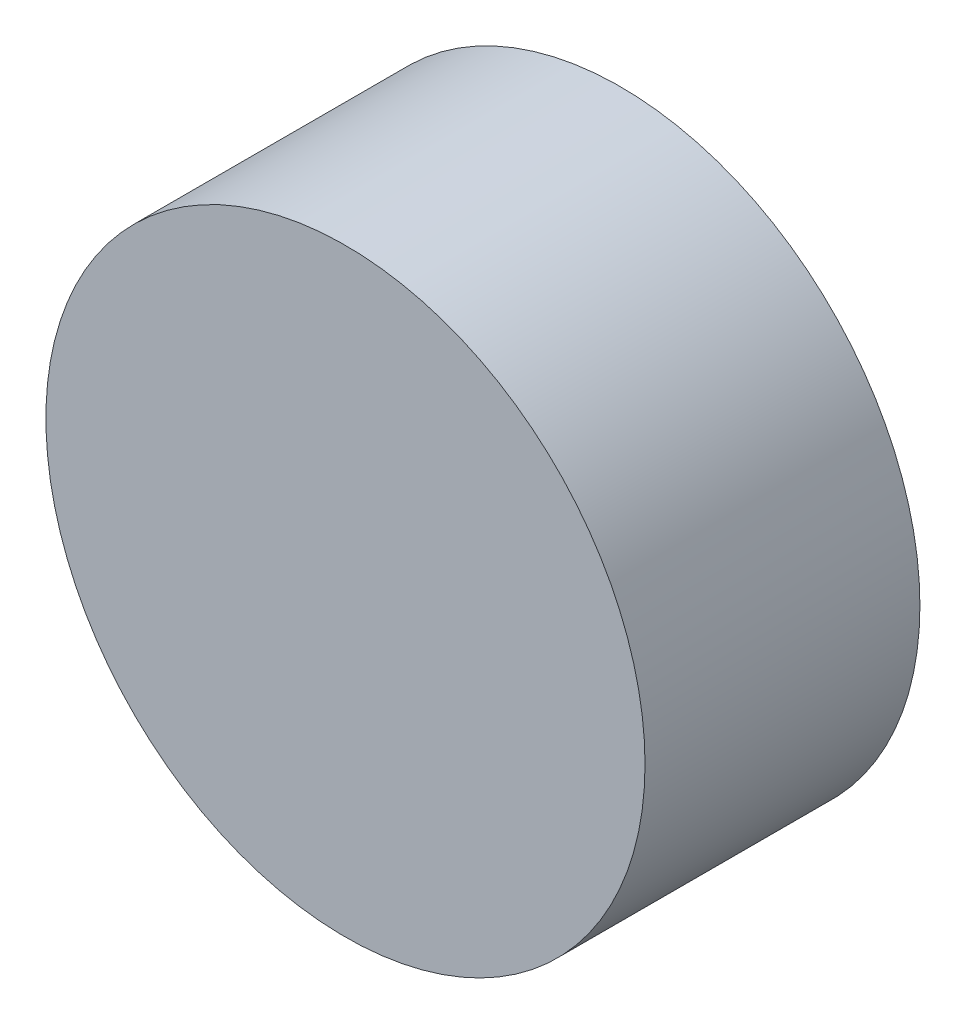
ISO-10303-21;
HEADER;
FILE_DESCRIPTION(('STEP AP214'),'2;1');
FILE_NAME('part.step','',(''),(''),'','','');
FILE_SCHEMA(('AUTOMOTIVE_DESIGN { 1 0 10303 214 1 1 1 1 }'));
ENDSEC;
DATA;
#1=APPLICATION_CONTEXT('core data for automotive mechanical design processes');
#2=APPLICATION_PROTOCOL_DEFINITION('international standard','automotive_design',2000,#1);
#3=PRODUCT_CONTEXT('',#1,'mechanical');
#4=PRODUCT('Part','Part','',(#3));
#5=PRODUCT_RELATED_PRODUCT_CATEGORY('part','',(#4));
#6=PRODUCT_DEFINITION_FORMATION('','',#4);
#7=PRODUCT_DEFINITION_CONTEXT('part definition',#1,'design');
#8=PRODUCT_DEFINITION('design','',#6,#7);
#9=PRODUCT_DEFINITION_SHAPE('','',#8);
#10=(LENGTH_UNIT() NAMED_UNIT(*) SI_UNIT(.MILLI.,.METRE.));
#11=(NAMED_UNIT(*) PLANE_ANGLE_UNIT() SI_UNIT($,.RADIAN.));
#12=(NAMED_UNIT(*) SI_UNIT($,.STERADIAN.) SOLID_ANGLE_UNIT());
#13=UNCERTAINTY_MEASURE_WITH_UNIT(LENGTH_MEASURE(1.E-05),#10,'distance_accuracy_value','');
#14=(GEOMETRIC_REPRESENTATION_CONTEXT(3) GLOBAL_UNCERTAINTY_ASSIGNED_CONTEXT((#13)) GLOBAL_UNIT_ASSIGNED_CONTEXT((#10,
#11,#12)) REPRESENTATION_CONTEXT('',''));
#15=CARTESIAN_POINT('',(0.,0.,0.));
#16=DIRECTION('',(0.,0.,1.));
#17=DIRECTION('',(1.,0.,0.));
#18=AXIS2_PLACEMENT_3D('',#15,#16,#17);
#19=CARTESIAN_POINT('',(0.,0.,6.00000000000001));
#20=DIRECTION('',(0.,0.,-1.));
#21=DIRECTION('',(-1.,0.,0.));
#22=AXIS2_PLACEMENT_3D('',#19,#20,#21);
#23=CYLINDRICAL_SURFACE('',#22,70.);
#24=CARTESIAN_POINT('',(0.,0.,6.00000000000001));
#25=DIRECTION('',(0.,0.,1.));
#26=DIRECTION('',(1.,0.,0.));
#27=AXIS2_PLACEMENT_3D('',#24,#25,#26);
#28=CIRCLE('',#27,70.);
#29=CARTESIAN_POINT('',(70.,0.,6.00000000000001));
#30=VERTEX_POINT('',#29);
#31=EDGE_CURVE('E12',#30,#30,#28,.T.);
#32=ORIENTED_EDGE('',*,*,#31,.F.);
#33=EDGE_LOOP('',(#32));
#34=FACE_BOUND('',#33,.T.);
#35=CARTESIAN_POINT('',(0.,0.,0.));
#36=DIRECTION('',(0.,0.,1.));
#37=DIRECTION('',(1.,0.,0.));
#38=AXIS2_PLACEMENT_3D('',#35,#36,#37);
#39=CIRCLE('',#38,70.);
#40=CARTESIAN_POINT('',(70.,0.,0.));
#41=VERTEX_POINT('',#40);
#42=EDGE_CURVE('E47',#41,#41,#39,.T.);
#43=ORIENTED_EDGE('',*,*,#42,.T.);
#44=EDGE_LOOP('',(#43));
#45=FACE_BOUND('',#44,.T.);
#46=ADVANCED_FACE('F41',(#34,#45),#23,.T.);
#47=CARTESIAN_POINT('',(0.,0.,0.));
#48=DIRECTION('',(0.,0.,1.));
#49=DIRECTION('',(1.,0.,0.));
#50=AXIS2_PLACEMENT_3D('',#47,#48,#49);
#51=PLANE('',#50);
#52=ORIENTED_EDGE('',*,*,#42,.F.);
#53=EDGE_LOOP('',(#52));
#54=FACE_BOUND('',#53,.T.);
#55=ADVANCED_FACE('F65',(#54),#51,.F.);
#56=CARTESIAN_POINT('',(0.,0.,6.00000000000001));
#57=DIRECTION('',(0.,0.,1.));
#58=DIRECTION('',(1.,0.,0.));
#59=AXIS2_PLACEMENT_3D('',#56,#57,#58);
#60=PLANE('',#59);
#61=CARTESIAN_POINT('',(0.,0.,6.00000000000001));
#62=DIRECTION('',(0.,0.,1.));
#63=DIRECTION('',(1.,0.,0.));
#64=AXIS2_PLACEMENT_3D('',#61,#62,#63);
#65=CIRCLE('',#64,85.);
#66=CARTESIAN_POINT('',(85.,0.,6.00000000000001));
#67=VERTEX_POINT('',#66);
#68=EDGE_CURVE('E55',#67,#67,#65,.T.);
#69=ORIENTED_EDGE('',*,*,#68,.F.);
#70=EDGE_LOOP('',(#69));
#71=FACE_BOUND('',#70,.T.);
#72=ORIENTED_EDGE('',*,*,#31,.T.);
#73=EDGE_LOOP('',(#72));
#74=FACE_BOUND('',#73,.T.);
#75=ADVANCED_FACE('F63',(#71,#74),#60,.F.);
#76=CARTESIAN_POINT('',(0.,0.,84.0000000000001));
#77=DIRECTION('',(0.,0.,-1.));
#78=DIRECTION('',(-1.,0.,0.));
#79=AXIS2_PLACEMENT_3D('',#76,#77,#78);
#80=CYLINDRICAL_SURFACE('',#79,85.);
#81=CARTESIAN_POINT('',(0.,0.,84.0000000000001));
#82=DIRECTION('',(0.,0.,1.));
#83=DIRECTION('',(1.,0.,0.));
#84=AXIS2_PLACEMENT_3D('',#81,#82,#83);
#85=CIRCLE('',#84,85.);
#86=CARTESIAN_POINT('',(85.,0.,84.0000000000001));
#87=VERTEX_POINT('',#86);
#88=EDGE_CURVE('E51',#87,#87,#85,.T.);
#89=ORIENTED_EDGE('',*,*,#88,.F.);
#90=EDGE_LOOP('',(#89));
#91=FACE_BOUND('',#90,.T.);
#92=ORIENTED_EDGE('',*,*,#68,.T.);
#93=EDGE_LOOP('',(#92));
#94=FACE_BOUND('',#93,.T.);
#95=ADVANCED_FACE('F61',(#91,#94),#80,.T.);
#96=CARTESIAN_POINT('',(0.,0.,84.0000000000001));
#97=DIRECTION('',(0.,0.,1.));
#98=DIRECTION('',(1.,0.,0.));
#99=AXIS2_PLACEMENT_3D('',#96,#97,#98);
#100=PLANE('',#99);
#101=ORIENTED_EDGE('',*,*,#88,.T.);
#102=EDGE_LOOP('',(#101));
#103=FACE_BOUND('',#102,.T.);
#104=ADVANCED_FACE('F71',(#103),#100,.T.);
#105=CLOSED_SHELL('',(#46,#55,#75,#95,#104));
#106=MANIFOLD_SOLID_BREP('B2',#105);
#107=ADVANCED_BREP_SHAPE_REPRESENTATION('',(#18,#106),#14);
#108=SHAPE_DEFINITION_REPRESENTATION(#9,#107);
ENDSEC;
END-ISO-10303-21;
